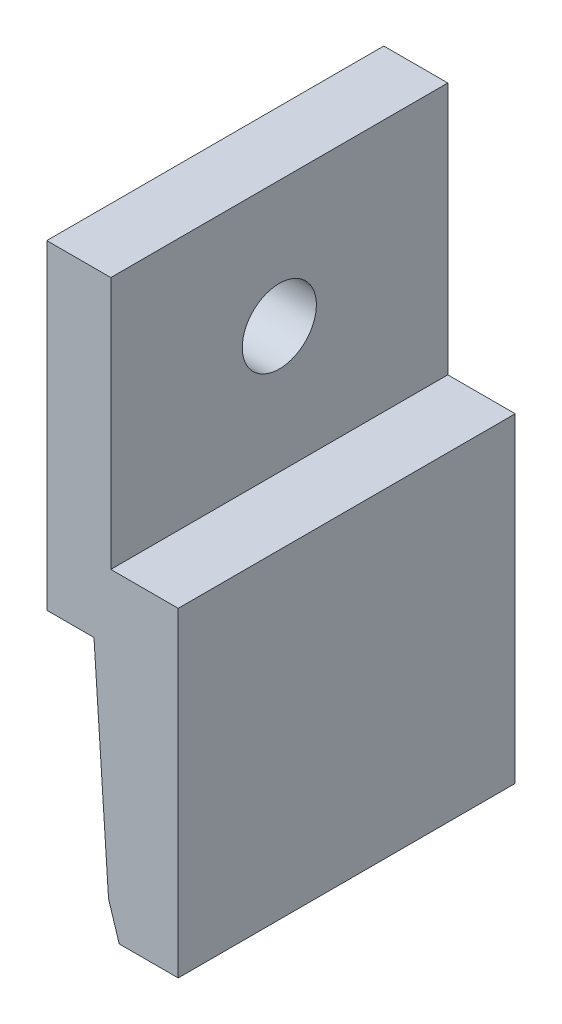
from build123d import *

# Parameters (mm, degrees)
EXTRUDE_1_DEPTH     = 20
CUT_EXTRUDE_1_DEPTH = 22
SKETCH_6_W          = 20
SKETCH_6_H          = 19
CUT_EXTRUDE_2_DEPTH = 0.2
CUT_EXTRUDE_3_DEPTH = 21
SKETCH_9_R          = 2.2
CUT_EXTRUDE_4_DEPTH = 5


with BuildPart() as part:
    # Sketch 1 → Extrude 1 (new body)
    with BuildSketch(Plane.XY):
        Polygon((-2, 15), (2, 15), (2, 0), (6, 0), (6, -19), (-2, -19), align=None)
    extrude(amount=EXTRUDE_1_DEPTH)

    # Sketch 4 → Cut-Extrude 1 (cut)
    with BuildSketch(Plane.XY.offset(20)):
        Polygon((2, -19), (-2, -19), (-2, -4), (1, -4), align=None)
    extrude(amount=-CUT_EXTRUDE_1_DEPTH, mode=Mode.SUBTRACT)

    # Sketch 6 → Cut-Extrude 2 (cut)
    with BuildSketch(Plane.ZY.offset(2)):
        with Locations((10, 5.5)):
            Rectangle(SKETCH_6_W, SKETCH_6_H)
    extrude(amount=-CUT_EXTRUDE_2_DEPTH, mode=Mode.SUBTRACT)

    # Sketch 8 → Cut-Extrude 3 (cut)
    with BuildSketch(Plane.XY.offset(20)):
        Polygon((2, -19), (1.866666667, -17), (2.5, -19), align=None)
    extrude(amount=-CUT_EXTRUDE_3_DEPTH, mode=Mode.SUBTRACT)

    # Sketch 9 → Cut-Extrude 4 (cut)
    with BuildSketch(Plane(origin=(2, 0, 0), x_dir=(0, 0, -1), z_dir=(1, 0, 0))):
        with Locations(Location((-10, 7.5, 0), (0, 0, 90))):
            Circle(SKETCH_9_R)
    extrude(amount=-CUT_EXTRUDE_4_DEPTH, mode=Mode.SUBTRACT)


solid = part.part
